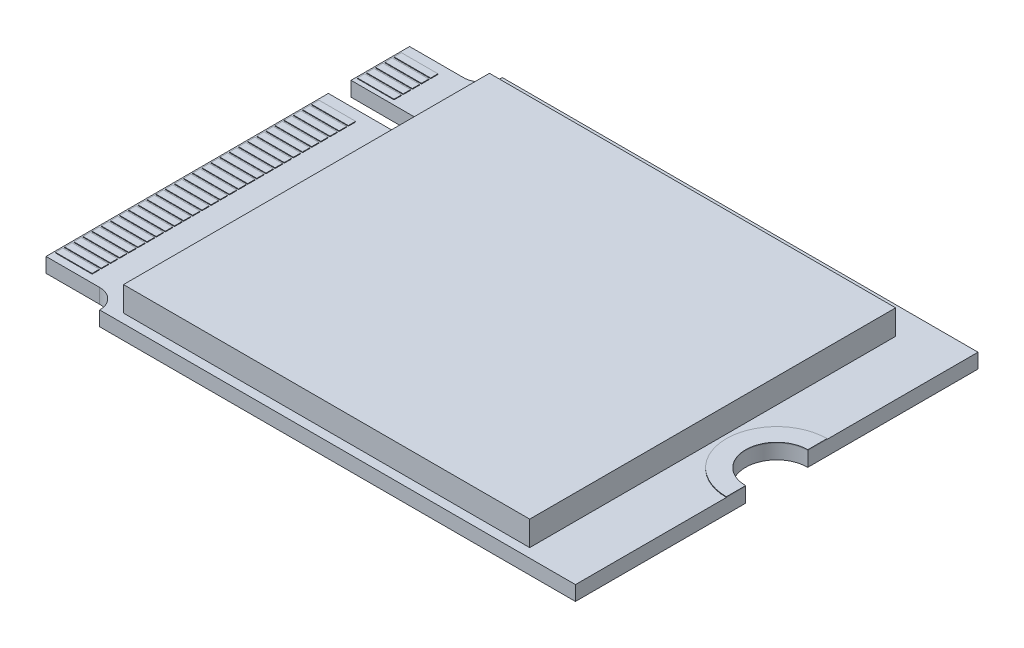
from build123d import *

# Parameters (mm, degrees)
BOSS_EXTRUDE1_DEPTH    = 0.8
SKETCH2_W              = 2
SKETCH2_H              = 0.4
BOSS_EXTRUDE2_DEPTH    = 0.035
BOSS_EXTRUDE2_2_DEPTH  = 0.035
BOSS_EXTRUDE2_3_DEPTH  = 0.035
BOSS_EXTRUDE2_4_DEPTH  = 0.035
BOSS_EXTRUDE2_5_DEPTH  = 0.035
BOSS_EXTRUDE2_6_DEPTH  = 0.035
BOSS_EXTRUDE2_7_DEPTH  = 0.035
BOSS_EXTRUDE2_8_DEPTH  = 0.035
BOSS_EXTRUDE2_9_DEPTH  = 0.035
BOSS_EXTRUDE2_10_DEPTH = 0.035
BOSS_EXTRUDE2_11_DEPTH = 0.035
BOSS_EXTRUDE2_12_DEPTH = 0.035
BOSS_EXTRUDE2_13_DEPTH = 0.035
BOSS_EXTRUDE2_14_DEPTH = 0.035
BOSS_EXTRUDE2_15_DEPTH = 0.035
BOSS_EXTRUDE2_16_DEPTH = 0.035
BOSS_EXTRUDE2_17_DEPTH = 0.035
BOSS_EXTRUDE2_18_DEPTH = 0.035
BOSS_EXTRUDE2_19_DEPTH = 0.035
BOSS_EXTRUDE2_20_DEPTH = 0.035
BOSS_EXTRUDE2_21_DEPTH = 0.035
BOSS_EXTRUDE2_22_DEPTH = 0.035
BOSS_EXTRUDE2_23_DEPTH = 0.035
BOSS_EXTRUDE2_24_DEPTH = 0.035
BOSS_EXTRUDE2_25_DEPTH = 0.035
BOSS_EXTRUDE2_26_DEPTH = 0.035
BOSS_EXTRUDE2_27_DEPTH = 0.035
BOSS_EXTRUDE2_28_DEPTH = 0.035
BOSS_EXTRUDE2_29_DEPTH = 0.035
BOSS_EXTRUDE2_30_DEPTH = 0.035
BOSS_EXTRUDE2_31_DEPTH = 0.035
BOSS_EXTRUDE2_32_DEPTH = 0.035
BOSS_EXTRUDE2_33_DEPTH = 0.035
BOSS_EXTRUDE2_34_DEPTH = 0.035
BOSS_EXTRUDE2_35_DEPTH = 0.035
BOSS_EXTRUDE3_START    = -0.8
SKETCH2_2_W            = 2
SKETCH2_2_H            = 0.4
BOSS_EXTRUDE3_DEPTH    = 0.035
BOSS_EXTRUDE3_2_DEPTH  = 0.035
BOSS_EXTRUDE3_3_DEPTH  = 0.035
BOSS_EXTRUDE3_4_DEPTH  = 0.035
BOSS_EXTRUDE3_5_DEPTH  = 0.035
BOSS_EXTRUDE3_6_DEPTH  = 0.035
BOSS_EXTRUDE3_7_DEPTH  = 0.035
BOSS_EXTRUDE3_8_DEPTH  = 0.035
BOSS_EXTRUDE3_9_DEPTH  = 0.035
BOSS_EXTRUDE3_10_DEPTH = 0.035
BOSS_EXTRUDE3_11_DEPTH = 0.035
BOSS_EXTRUDE3_12_DEPTH = 0.035
BOSS_EXTRUDE3_13_DEPTH = 0.035
BOSS_EXTRUDE3_14_DEPTH = 0.035
BOSS_EXTRUDE3_15_DEPTH = 0.035
BOSS_EXTRUDE3_16_DEPTH = 0.035
BOSS_EXTRUDE3_17_DEPTH = 0.035
BOSS_EXTRUDE3_18_DEPTH = 0.035
BOSS_EXTRUDE3_19_DEPTH = 0.035
BOSS_EXTRUDE3_20_DEPTH = 0.035
BOSS_EXTRUDE3_21_DEPTH = 0.035
BOSS_EXTRUDE3_22_DEPTH = 0.035
BOSS_EXTRUDE3_23_DEPTH = 0.035
BOSS_EXTRUDE3_24_DEPTH = 0.035
BOSS_EXTRUDE3_25_DEPTH = 0.035
BOSS_EXTRUDE3_26_DEPTH = 0.035
BOSS_EXTRUDE3_27_DEPTH = 0.035
BOSS_EXTRUDE3_28_DEPTH = 0.035
BOSS_EXTRUDE3_29_DEPTH = 0.035
SKETCH3_W              = 22.2
SKETCH3_H              = 20
BOSS_EXTRUDE4_DEPTH    = 1.35
SKETCH4_W              = 2
SKETCH4_H              = 0.4
BOSS_EXTRUDE5_DEPTH    = 0.035
BOSS_EXTRUDE5_2_DEPTH  = 0.035
BOSS_EXTRUDE5_3_DEPTH  = 0.035
BOSS_EXTRUDE5_4_DEPTH  = 0.035


with BuildPart() as part:
    # Sketch1 → Boss-Extrude1 (new body)
    with BuildSketch(Plane(origin=(0, 0, 0), x_dir=(1, 0, 0), z_dir=(0, 1, 0))):
        with BuildLine():
            Line((-15, 0), (-15, 5.495))
            Line((-15, 5.495), (-11.6, 5.495))
            ThreePointArc((-11.6, 5.495), (-10.98, 6.115), (-11.6, 6.735))
            Line((-11.6, 6.735), (-15, 6.735))
            Line((-15, 6.735), (-15, 9.935))
            Line((-15, 9.935), (-12.065, 9.935))
            ThreePointArc((-12.065, 9.935), (-11.311931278, 10.246931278), (-11, 11))
            Line((-11, 11), (0, 11))
            Line((0, 11), (15, 11))
            Line((15, 11), (15, 1.7))
            ThreePointArc((15, 1.7), (13.3, 0), (15, -1.7))
            Line((15, -1.7), (15, -11))
            Line((15, -11), (-11, -11))
            ThreePointArc((-11, -11), (-11.311931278, -10.246931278), (-12.065, -9.935))
            Line((-12.065, -9.935), (-15, -9.935))
            Line((-15, -9.935), (-15, 0))
        make_face()
    extrude(amount=BOSS_EXTRUDE1_DEPTH)

    # Sketch3 → Boss-Extrude4 (add)
    with BuildSketch(Plane(origin=(0, 0.8, 0), x_dir=(1, 0, 0), z_dir=(0, 1, 0))):
        with Locations((0.9, -0.5)):
            Rectangle(SKETCH3_W, SKETCH3_H)
    extrude(amount=BOSS_EXTRUDE4_DEPTH)


with BuildPart() as body_2:
    # Sketch2 → Boss-Extrude2 (new body)
    with BuildSketch(Plane(origin=(0, 0.8, 0), x_dir=(1, 0, 0), z_dir=(0, 1, 0))):
        with Locations((-13.9, 9.185)):
            Rectangle(SKETCH2_W, SKETCH2_H)
    extrude(amount=BOSS_EXTRUDE2_DEPTH)


with BuildPart() as body_3:
    # Sketch2 → Boss-Extrude2 2 (new body)
    with BuildSketch(Plane(origin=(0, 0.8, 0), x_dir=(1, 0, 0), z_dir=(0, 1, 0))):
        with Locations((-13.9, 8.685)):
            Rectangle(SKETCH2_W, SKETCH2_H)
    extrude(amount=BOSS_EXTRUDE2_2_DEPTH)


with BuildPart() as body_4:
    # Sketch2 → Boss-Extrude2 3 (new body)
    with BuildSketch(Plane(origin=(0, 0.8, 0), x_dir=(1, 0, 0), z_dir=(0, 1, 0))):
        with Locations((-13.9, 8.185)):
            Rectangle(SKETCH2_W, SKETCH2_H)
    extrude(amount=BOSS_EXTRUDE2_3_DEPTH)


with BuildPart() as body_5:
    # Sketch2 → Boss-Extrude2 4 (new body)
    with BuildSketch(Plane(origin=(0, 0.8, 0), x_dir=(1, 0, 0), z_dir=(0, 1, 0))):
        with Locations((-13.9, 7.685)):
            Rectangle(SKETCH2_W, SKETCH2_H)
    extrude(amount=BOSS_EXTRUDE2_4_DEPTH)


with BuildPart() as body_6:
    # Sketch2 → Boss-Extrude2 5 (new body)
    with BuildSketch(Plane(origin=(0, 0.8, 0), x_dir=(1, 0, 0), z_dir=(0, 1, 0))):
        with Locations((-13.9, 4.685)):
            Rectangle(SKETCH2_W, SKETCH2_H)
    extrude(amount=BOSS_EXTRUDE2_5_DEPTH)


with BuildPart() as body_7:
    # Sketch2 → Boss-Extrude2 6 (new body)
    with BuildSketch(Plane(origin=(0, 0.8, 0), x_dir=(1, 0, 0), z_dir=(0, 1, 0))):
        with Locations((-13.9, 4.185)):
            Rectangle(SKETCH2_W, SKETCH2_H)
    extrude(amount=BOSS_EXTRUDE2_6_DEPTH)


with BuildPart() as body_8:
    # Sketch2 → Boss-Extrude2 7 (new body)
    with BuildSketch(Plane(origin=(0, 0.8, 0), x_dir=(1, 0, 0), z_dir=(0, 1, 0))):
        with Locations((-13.9, 3.685)):
            Rectangle(SKETCH2_W, SKETCH2_H)
    extrude(amount=BOSS_EXTRUDE2_7_DEPTH)


with BuildPart() as body_9:
    # Sketch2 → Boss-Extrude2 8 (new body)
    with BuildSketch(Plane(origin=(0, 0.8, 0), x_dir=(1, 0, 0), z_dir=(0, 1, 0))):
        with Locations((-13.9, 3.185)):
            Rectangle(SKETCH2_W, SKETCH2_H)
    extrude(amount=BOSS_EXTRUDE2_8_DEPTH)


with BuildPart() as body_10:
    # Sketch2 → Boss-Extrude2 9 (new body)
    with BuildSketch(Plane(origin=(0, 0.8, 0), x_dir=(1, 0, 0), z_dir=(0, 1, 0))):
        with Locations((-13.9, 2.685)):
            Rectangle(SKETCH2_W, SKETCH2_H)
    extrude(amount=BOSS_EXTRUDE2_9_DEPTH)


with BuildPart() as body_11:
    # Sketch2 → Boss-Extrude2 10 (new body)
    with BuildSketch(Plane(origin=(0, 0.8, 0), x_dir=(1, 0, 0), z_dir=(0, 1, 0))):
        with Locations((-13.9, 2.185)):
            Rectangle(SKETCH2_W, SKETCH2_H)
    extrude(amount=BOSS_EXTRUDE2_10_DEPTH)


with BuildPart() as body_12:
    # Sketch2 → Boss-Extrude2 11 (new body)
    with BuildSketch(Plane(origin=(0, 0.8, 0), x_dir=(1, 0, 0), z_dir=(0, 1, 0))):
        with Locations((-13.9, 1.685)):
            Rectangle(SKETCH2_W, SKETCH2_H)
    extrude(amount=BOSS_EXTRUDE2_11_DEPTH)


with BuildPart() as body_13:
    # Sketch2 → Boss-Extrude2 12 (new body)
    with BuildSketch(Plane(origin=(0, 0.8, 0), x_dir=(1, 0, 0), z_dir=(0, 1, 0))):
        with Locations((-13.9, 1.185)):
            Rectangle(SKETCH2_W, SKETCH2_H)
    extrude(amount=BOSS_EXTRUDE2_12_DEPTH)


with BuildPart() as body_14:
    # Sketch2 → Boss-Extrude2 13 (new body)
    with BuildSketch(Plane(origin=(0, 0.8, 0), x_dir=(1, 0, 0), z_dir=(0, 1, 0))):
        with Locations((-13.9, 0.685)):
            Rectangle(SKETCH2_W, SKETCH2_H)
    extrude(amount=BOSS_EXTRUDE2_13_DEPTH)


with BuildPart() as body_15:
    # Sketch2 → Boss-Extrude2 14 (new body)
    with BuildSketch(Plane(origin=(0, 0.8, 0), x_dir=(1, 0, 0), z_dir=(0, 1, 0))):
        with Locations((-13.9, 0.185)):
            Rectangle(SKETCH2_W, SKETCH2_H)
    extrude(amount=BOSS_EXTRUDE2_14_DEPTH)


with BuildPart() as body_16:
    # Sketch2 → Boss-Extrude2 15 (new body)
    with BuildSketch(Plane(origin=(0, 0.8, 0), x_dir=(1, 0, 0), z_dir=(0, 1, 0))):
        with Locations((-13.9, -0.315)):
            Rectangle(SKETCH2_W, SKETCH2_H)
    extrude(amount=BOSS_EXTRUDE2_15_DEPTH)


with BuildPart() as body_17:
    # Sketch2 → Boss-Extrude2 16 (new body)
    with BuildSketch(Plane(origin=(0, 0.8, 0), x_dir=(1, 0, 0), z_dir=(0, 1, 0))):
        with Locations((-13.9, -0.815)):
            Rectangle(SKETCH2_W, SKETCH2_H)
    extrude(amount=BOSS_EXTRUDE2_16_DEPTH)


with BuildPart() as body_18:
    # Sketch2 → Boss-Extrude2 17 (new body)
    with BuildSketch(Plane(origin=(0, 0.8, 0), x_dir=(1, 0, 0), z_dir=(0, 1, 0))):
        with Locations((-13.9, -1.315)):
            Rectangle(SKETCH2_W, SKETCH2_H)
    extrude(amount=BOSS_EXTRUDE2_17_DEPTH)


with BuildPart() as body_19:
    # Sketch2 → Boss-Extrude2 18 (new body)
    with BuildSketch(Plane(origin=(0, 0.8, 0), x_dir=(1, 0, 0), z_dir=(0, 1, 0))):
        with Locations((-13.9, -1.815)):
            Rectangle(SKETCH2_W, SKETCH2_H)
    extrude(amount=BOSS_EXTRUDE2_18_DEPTH)


with BuildPart() as body_20:
    # Sketch2 → Boss-Extrude2 19 (new body)
    with BuildSketch(Plane(origin=(0, 0.8, 0), x_dir=(1, 0, 0), z_dir=(0, 1, 0))):
        with Locations((-13.9, -2.315)):
            Rectangle(SKETCH2_W, SKETCH2_H)
    extrude(amount=BOSS_EXTRUDE2_19_DEPTH)


with BuildPart() as body_21:
    # Sketch2 → Boss-Extrude2 20 (new body)
    with BuildSketch(Plane(origin=(0, 0.8, 0), x_dir=(1, 0, 0), z_dir=(0, 1, 0))):
        with Locations((-13.9, -2.815)):
            Rectangle(SKETCH2_W, SKETCH2_H)
    extrude(amount=BOSS_EXTRUDE2_20_DEPTH)


with BuildPart() as body_22:
    # Sketch2 → Boss-Extrude2 21 (new body)
    with BuildSketch(Plane(origin=(0, 0.8, 0), x_dir=(1, 0, 0), z_dir=(0, 1, 0))):
        with Locations((-13.9, -3.315)):
            Rectangle(SKETCH2_W, SKETCH2_H)
    extrude(amount=BOSS_EXTRUDE2_21_DEPTH)


with BuildPart() as body_23:
    # Sketch2 → Boss-Extrude2 22 (new body)
    with BuildSketch(Plane(origin=(0, 0.8, 0), x_dir=(1, 0, 0), z_dir=(0, 1, 0))):
        with Locations((-13.9, -3.815)):
            Rectangle(SKETCH2_W, SKETCH2_H)
    extrude(amount=BOSS_EXTRUDE2_22_DEPTH)


with BuildPart() as body_24:
    # Sketch2 → Boss-Extrude2 23 (new body)
    with BuildSketch(Plane(origin=(0, 0.8, 0), x_dir=(1, 0, 0), z_dir=(0, 1, 0))):
        with Locations((-13.9, -4.315)):
            Rectangle(SKETCH2_W, SKETCH2_H)
    extrude(amount=BOSS_EXTRUDE2_23_DEPTH)


with BuildPart() as body_25:
    # Sketch2 → Boss-Extrude2 24 (new body)
    with BuildSketch(Plane(origin=(0, 0.8, 0), x_dir=(1, 0, 0), z_dir=(0, 1, 0))):
        with Locations((-13.9, -4.815)):
            Rectangle(SKETCH2_W, SKETCH2_H)
    extrude(amount=BOSS_EXTRUDE2_24_DEPTH)


with BuildPart() as body_26:
    # Sketch2 → Boss-Extrude2 25 (new body)
    with BuildSketch(Plane(origin=(0, 0.8, 0), x_dir=(1, 0, 0), z_dir=(0, 1, 0))):
        with Locations((-13.9, -5.315)):
            Rectangle(SKETCH2_W, SKETCH2_H)
    extrude(amount=BOSS_EXTRUDE2_25_DEPTH)


with BuildPart() as body_27:
    # Sketch2 → Boss-Extrude2 26 (new body)
    with BuildSketch(Plane(origin=(0, 0.8, 0), x_dir=(1, 0, 0), z_dir=(0, 1, 0))):
        with Locations((-13.9, -5.815)):
            Rectangle(SKETCH2_W, SKETCH2_H)
    extrude(amount=BOSS_EXTRUDE2_26_DEPTH)


with BuildPart() as body_28:
    # Sketch2 → Boss-Extrude2 27 (new body)
    with BuildSketch(Plane(origin=(0, 0.8, 0), x_dir=(1, 0, 0), z_dir=(0, 1, 0))):
        with Locations((-13.9, -6.315)):
            Rectangle(SKETCH2_W, SKETCH2_H)
    extrude(amount=BOSS_EXTRUDE2_27_DEPTH)


with BuildPart() as body_29:
    # Sketch2 → Boss-Extrude2 28 (new body)
    with BuildSketch(Plane(origin=(0, 0.8, 0), x_dir=(1, 0, 0), z_dir=(0, 1, 0))):
        with Locations((-13.9, -6.815)):
            Rectangle(SKETCH2_W, SKETCH2_H)
    extrude(amount=BOSS_EXTRUDE2_28_DEPTH)


with BuildPart() as body_30:
    # Sketch2 → Boss-Extrude2 29 (new body)
    with BuildSketch(Plane(origin=(0, 0.8, 0), x_dir=(1, 0, 0), z_dir=(0, 1, 0))):
        with Locations((-13.9, -7.315)):
            Rectangle(SKETCH2_W, SKETCH2_H)
    extrude(amount=BOSS_EXTRUDE2_29_DEPTH)


with BuildPart() as body_31:
    # Sketch2 → Boss-Extrude2 30 (new body)
    with BuildSketch(Plane(origin=(0, 0.8, 0), x_dir=(1, 0, 0), z_dir=(0, 1, 0))):
        with Locations((-13.9, -7.815)):
            Rectangle(SKETCH2_W, SKETCH2_H)
    extrude(amount=BOSS_EXTRUDE2_30_DEPTH)


with BuildPart() as body_32:
    # Sketch2 → Boss-Extrude2 31 (new body)
    with BuildSketch(Plane(origin=(0, 0.8, 0), x_dir=(1, 0, 0), z_dir=(0, 1, 0))):
        with Locations((-13.9, -8.315)):
            Rectangle(SKETCH2_W, SKETCH2_H)
    extrude(amount=BOSS_EXTRUDE2_31_DEPTH)


with BuildPart() as body_33:
    # Sketch2 → Boss-Extrude2 32 (new body)
    with BuildSketch(Plane(origin=(0, 0.8, 0), x_dir=(1, 0, 0), z_dir=(0, 1, 0))):
        with Locations((-13.9, -8.815)):
            Rectangle(SKETCH2_W, SKETCH2_H)
    extrude(amount=BOSS_EXTRUDE2_32_DEPTH)


with BuildPart() as body_34:
    # Sketch2 → Boss-Extrude2 33 (new body)
    with BuildSketch(Plane(origin=(0, 0.8, 0), x_dir=(1, 0, 0), z_dir=(0, 1, 0))):
        with Locations((-13.9, -9.315)):
            Rectangle(SKETCH2_W, SKETCH2_H)
    extrude(amount=BOSS_EXTRUDE2_33_DEPTH)


with BuildPart() as body_35:
    # Sketch2 → Boss-Extrude2 34 (new body)
    with BuildSketch(Plane(origin=(0, 0.8, 0), x_dir=(1, 0, 0), z_dir=(0, 1, 0))):
        with Locations((-13.9, 7.185)):
            Rectangle(SKETCH2_W, SKETCH2_H)
    extrude(amount=BOSS_EXTRUDE2_34_DEPTH)


with BuildPart() as body_36:
    # Sketch2 → Boss-Extrude2 35 (new body)
    with BuildSketch(Plane(origin=(0, 0.8, 0), x_dir=(1, 0, 0), z_dir=(0, 1, 0))):
        with BuildLine():
            Line((15, 1.7), (15, 2.75))
            ThreePointArc((15, 2.75), (12.25, 0), (15, -2.75))
            Line((15, -2.75), (15, -1.7))
            ThreePointArc((15, -1.7), (13.3, 0), (15, 1.7))
        make_face()
    extrude(amount=BOSS_EXTRUDE2_35_DEPTH)


with BuildPart() as body_37:
    # Sketch2_2 → Boss-Extrude3 (new body)
    with BuildSketch(Plane(origin=(0, 0.8, 0), x_dir=(1, 0, 0), z_dir=(0, 1, 0)).offset(BOSS_EXTRUDE3_START)):
        with Locations((-13.9, 4.685)):
            Rectangle(SKETCH2_2_W, SKETCH2_2_H)
    extrude(amount=-BOSS_EXTRUDE3_DEPTH)


with BuildPart() as body_38:
    # Sketch2_2 → Boss-Extrude3 2 (new body)
    with BuildSketch(Plane(origin=(0, 0.8, 0), x_dir=(1, 0, 0), z_dir=(0, 1, 0)).offset(BOSS_EXTRUDE3_START)):
        with Locations((-13.9, 4.185)):
            Rectangle(SKETCH2_2_W, SKETCH2_2_H)
    extrude(amount=-BOSS_EXTRUDE3_2_DEPTH)


with BuildPart() as body_39:
    # Sketch2_2 → Boss-Extrude3 3 (new body)
    with BuildSketch(Plane(origin=(0, 0.8, 0), x_dir=(1, 0, 0), z_dir=(0, 1, 0)).offset(BOSS_EXTRUDE3_START)):
        with Locations((-13.9, 3.685)):
            Rectangle(SKETCH2_2_W, SKETCH2_2_H)
    extrude(amount=-BOSS_EXTRUDE3_3_DEPTH)


with BuildPart() as body_40:
    # Sketch2_2 → Boss-Extrude3 4 (new body)
    with BuildSketch(Plane(origin=(0, 0.8, 0), x_dir=(1, 0, 0), z_dir=(0, 1, 0)).offset(BOSS_EXTRUDE3_START)):
        with Locations((-13.9, 3.185)):
            Rectangle(SKETCH2_2_W, SKETCH2_2_H)
    extrude(amount=-BOSS_EXTRUDE3_4_DEPTH)


with BuildPart() as body_41:
    # Sketch2_2 → Boss-Extrude3 5 (new body)
    with BuildSketch(Plane(origin=(0, 0.8, 0), x_dir=(1, 0, 0), z_dir=(0, 1, 0)).offset(BOSS_EXTRUDE3_START)):
        with Locations((-13.9, 2.185)):
            Rectangle(SKETCH2_2_W, SKETCH2_2_H)
    extrude(amount=-BOSS_EXTRUDE3_5_DEPTH)


with BuildPart() as body_42:
    # Sketch2_2 → Boss-Extrude3 6 (new body)
    with BuildSketch(Plane(origin=(0, 0.8, 0), x_dir=(1, 0, 0), z_dir=(0, 1, 0)).offset(BOSS_EXTRUDE3_START)):
        with Locations((-13.9, 1.185)):
            Rectangle(SKETCH2_2_W, SKETCH2_2_H)
    extrude(amount=-BOSS_EXTRUDE3_6_DEPTH)


with BuildPart() as body_43:
    # Sketch2_2 → Boss-Extrude3 7 (new body)
    with BuildSketch(Plane(origin=(0, 0.8, 0), x_dir=(1, 0, 0), z_dir=(0, 1, 0)).offset(BOSS_EXTRUDE3_START)):
        with Locations((-13.9, 0.685)):
            Rectangle(SKETCH2_2_W, SKETCH2_2_H)
    extrude(amount=-BOSS_EXTRUDE3_7_DEPTH)


with BuildPart() as body_44:
    # Sketch2_2 → Boss-Extrude3 8 (new body)
    with BuildSketch(Plane(origin=(0, 0.8, 0), x_dir=(1, 0, 0), z_dir=(0, 1, 0)).offset(BOSS_EXTRUDE3_START)):
        with Locations((-13.9, 0.185)):
            Rectangle(SKETCH2_2_W, SKETCH2_2_H)
    extrude(amount=-BOSS_EXTRUDE3_8_DEPTH)


with BuildPart() as body_45:
    # Sketch2_2 → Boss-Extrude3 9 (new body)
    with BuildSketch(Plane(origin=(0, 0.8, 0), x_dir=(1, 0, 0), z_dir=(0, 1, 0)).offset(BOSS_EXTRUDE3_START)):
        with Locations((-13.9, -5.815)):
            Rectangle(SKETCH2_2_W, SKETCH2_2_H)
    extrude(amount=-BOSS_EXTRUDE3_9_DEPTH)


with BuildPart() as body_46:
    # Sketch2_2 → Boss-Extrude3 10 (new body)
    with BuildSketch(Plane(origin=(0, 0.8, 0), x_dir=(1, 0, 0), z_dir=(0, 1, 0)).offset(BOSS_EXTRUDE3_START)):
        with Locations((-13.9, -7.315)):
            Rectangle(SKETCH2_2_W, SKETCH2_2_H)
    extrude(amount=-BOSS_EXTRUDE3_10_DEPTH)


with BuildPart() as body_47:
    # Sketch2_2 → Boss-Extrude3 11 (new body)
    with BuildSketch(Plane(origin=(0, 0.8, 0), x_dir=(1, 0, 0), z_dir=(0, 1, 0)).offset(BOSS_EXTRUDE3_START)):
        with Locations((-13.9, -8.315)):
            Rectangle(SKETCH2_2_W, SKETCH2_2_H)
    extrude(amount=-BOSS_EXTRUDE3_11_DEPTH)


with BuildPart() as body_48:
    # Sketch2_2 → Boss-Extrude3 12 (new body)
    with BuildSketch(Plane(origin=(0, 0.8, 0), x_dir=(1, 0, 0), z_dir=(0, 1, 0)).offset(BOSS_EXTRUDE3_START)):
        with Locations((-13.9, -8.815)):
            Rectangle(SKETCH2_2_W, SKETCH2_2_H)
    extrude(amount=-BOSS_EXTRUDE3_12_DEPTH)


with BuildPart() as body_49:
    # Sketch2_2 → Boss-Extrude3 13 (new body)
    with BuildSketch(Plane(origin=(0, 0.8, 0), x_dir=(1, 0, 0), z_dir=(0, 1, 0)).offset(BOSS_EXTRUDE3_START)):
        with Locations((-13.9, 2.685)):
            Rectangle(SKETCH2_2_W, SKETCH2_2_H)
    extrude(amount=-BOSS_EXTRUDE3_13_DEPTH)


with BuildPart() as body_50:
    # Sketch2_2 → Boss-Extrude3 14 (new body)
    with BuildSketch(Plane(origin=(0, 0.8, 0), x_dir=(1, 0, 0), z_dir=(0, 1, 0)).offset(BOSS_EXTRUDE3_START)):
        with Locations((-13.9, 1.685)):
            Rectangle(SKETCH2_2_W, SKETCH2_2_H)
    extrude(amount=-BOSS_EXTRUDE3_14_DEPTH)


with BuildPart() as body_51:
    # Sketch2_2 → Boss-Extrude3 15 (new body)
    with BuildSketch(Plane(origin=(0, 0.8, 0), x_dir=(1, 0, 0), z_dir=(0, 1, 0)).offset(BOSS_EXTRUDE3_START)):
        with Locations((-13.9, -0.315)):
            Rectangle(SKETCH2_2_W, SKETCH2_2_H)
    extrude(amount=-BOSS_EXTRUDE3_15_DEPTH)


with BuildPart() as body_52:
    # Sketch2_2 → Boss-Extrude3 16 (new body)
    with BuildSketch(Plane(origin=(0, 0.8, 0), x_dir=(1, 0, 0), z_dir=(0, 1, 0)).offset(BOSS_EXTRUDE3_START)):
        with Locations((-13.9, -0.815)):
            Rectangle(SKETCH2_2_W, SKETCH2_2_H)
    extrude(amount=-BOSS_EXTRUDE3_16_DEPTH)


with BuildPart() as body_53:
    # Sketch2_2 → Boss-Extrude3 17 (new body)
    with BuildSketch(Plane(origin=(0, 0.8, 0), x_dir=(1, 0, 0), z_dir=(0, 1, 0)).offset(BOSS_EXTRUDE3_START)):
        with Locations((-13.9, -1.315)):
            Rectangle(SKETCH2_2_W, SKETCH2_2_H)
    extrude(amount=-BOSS_EXTRUDE3_17_DEPTH)


with BuildPart() as body_54:
    # Sketch2_2 → Boss-Extrude3 18 (new body)
    with BuildSketch(Plane(origin=(0, 0.8, 0), x_dir=(1, 0, 0), z_dir=(0, 1, 0)).offset(BOSS_EXTRUDE3_START)):
        with Locations((-13.9, -1.815)):
            Rectangle(SKETCH2_2_W, SKETCH2_2_H)
    extrude(amount=-BOSS_EXTRUDE3_18_DEPTH)


with BuildPart() as body_55:
    # Sketch2_2 → Boss-Extrude3 19 (new body)
    with BuildSketch(Plane(origin=(0, 0.8, 0), x_dir=(1, 0, 0), z_dir=(0, 1, 0)).offset(BOSS_EXTRUDE3_START)):
        with Locations((-13.9, -2.315)):
            Rectangle(SKETCH2_2_W, SKETCH2_2_H)
    extrude(amount=-BOSS_EXTRUDE3_19_DEPTH)


with BuildPart() as body_56:
    # Sketch2_2 → Boss-Extrude3 20 (new body)
    with BuildSketch(Plane(origin=(0, 0.8, 0), x_dir=(1, 0, 0), z_dir=(0, 1, 0)).offset(BOSS_EXTRUDE3_START)):
        with Locations((-13.9, -2.815)):
            Rectangle(SKETCH2_2_W, SKETCH2_2_H)
    extrude(amount=-BOSS_EXTRUDE3_20_DEPTH)


with BuildPart() as body_57:
    # Sketch2_2 → Boss-Extrude3 21 (new body)
    with BuildSketch(Plane(origin=(0, 0.8, 0), x_dir=(1, 0, 0), z_dir=(0, 1, 0)).offset(BOSS_EXTRUDE3_START)):
        with Locations((-13.9, -3.315)):
            Rectangle(SKETCH2_2_W, SKETCH2_2_H)
    extrude(amount=-BOSS_EXTRUDE3_21_DEPTH)


with BuildPart() as body_58:
    # Sketch2_2 → Boss-Extrude3 22 (new body)
    with BuildSketch(Plane(origin=(0, 0.8, 0), x_dir=(1, 0, 0), z_dir=(0, 1, 0)).offset(BOSS_EXTRUDE3_START)):
        with Locations((-13.9, -3.815)):
            Rectangle(SKETCH2_2_W, SKETCH2_2_H)
    extrude(amount=-BOSS_EXTRUDE3_22_DEPTH)


with BuildPart() as body_59:
    # Sketch2_2 → Boss-Extrude3 23 (new body)
    with BuildSketch(Plane(origin=(0, 0.8, 0), x_dir=(1, 0, 0), z_dir=(0, 1, 0)).offset(BOSS_EXTRUDE3_START)):
        with Locations((-13.9, -4.315)):
            Rectangle(SKETCH2_2_W, SKETCH2_2_H)
    extrude(amount=-BOSS_EXTRUDE3_23_DEPTH)


with BuildPart() as body_60:
    # Sketch2_2 → Boss-Extrude3 24 (new body)
    with BuildSketch(Plane(origin=(0, 0.8, 0), x_dir=(1, 0, 0), z_dir=(0, 1, 0)).offset(BOSS_EXTRUDE3_START)):
        with Locations((-13.9, -4.815)):
            Rectangle(SKETCH2_2_W, SKETCH2_2_H)
    extrude(amount=-BOSS_EXTRUDE3_24_DEPTH)


with BuildPart() as body_61:
    # Sketch2_2 → Boss-Extrude3 25 (new body)
    with BuildSketch(Plane(origin=(0, 0.8, 0), x_dir=(1, 0, 0), z_dir=(0, 1, 0)).offset(BOSS_EXTRUDE3_START)):
        with Locations((-13.9, -5.315)):
            Rectangle(SKETCH2_2_W, SKETCH2_2_H)
    extrude(amount=-BOSS_EXTRUDE3_25_DEPTH)


with BuildPart() as body_62:
    # Sketch2_2 → Boss-Extrude3 26 (new body)
    with BuildSketch(Plane(origin=(0, 0.8, 0), x_dir=(1, 0, 0), z_dir=(0, 1, 0)).offset(BOSS_EXTRUDE3_START)):
        with Locations((-13.9, -6.315)):
            Rectangle(SKETCH2_2_W, SKETCH2_2_H)
    extrude(amount=-BOSS_EXTRUDE3_26_DEPTH)


with BuildPart() as body_63:
    # Sketch2_2 → Boss-Extrude3 27 (new body)
    with BuildSketch(Plane(origin=(0, 0.8, 0), x_dir=(1, 0, 0), z_dir=(0, 1, 0)).offset(BOSS_EXTRUDE3_START)):
        with Locations((-13.9, -6.815)):
            Rectangle(SKETCH2_2_W, SKETCH2_2_H)
    extrude(amount=-BOSS_EXTRUDE3_27_DEPTH)


with BuildPart() as body_64:
    # Sketch2_2 → Boss-Extrude3 28 (new body)
    with BuildSketch(Plane(origin=(0, 0.8, 0), x_dir=(1, 0, 0), z_dir=(0, 1, 0)).offset(BOSS_EXTRUDE3_START)):
        with Locations((-13.9, -7.815)):
            Rectangle(SKETCH2_2_W, SKETCH2_2_H)
    extrude(amount=-BOSS_EXTRUDE3_28_DEPTH)


with BuildPart() as body_65:
    # Sketch2_2 → Boss-Extrude3 29 (new body)
    with BuildSketch(Plane(origin=(0, 0.8, 0), x_dir=(1, 0, 0), z_dir=(0, 1, 0)).offset(BOSS_EXTRUDE3_START)):
        with Locations((-13.9, -9.315)):
            Rectangle(SKETCH2_2_W, SKETCH2_2_H)
    extrude(amount=-BOSS_EXTRUDE3_29_DEPTH)


with BuildPart() as body_66:
    # Sketch4 → Boss-Extrude5 (new body)
    with BuildSketch(Plane.XZ):
        with Locations((-13.9, -7.435)):
            Rectangle(SKETCH4_W, SKETCH4_H)
    extrude(amount=BOSS_EXTRUDE5_DEPTH)


with BuildPart() as body_67:
    # Sketch4 → Boss-Extrude5 2 (new body)
    with BuildSketch(Plane.XZ):
        with Locations((-13.9, -7.935)):
            Rectangle(SKETCH4_W, SKETCH4_H)
    extrude(amount=BOSS_EXTRUDE5_2_DEPTH)


with BuildPart() as body_68:
    # Sketch4 → Boss-Extrude5 3 (new body)
    with BuildSketch(Plane.XZ):
        with Locations((-13.9, -8.435)):
            Rectangle(SKETCH4_W, SKETCH4_H)
    extrude(amount=BOSS_EXTRUDE5_3_DEPTH)


with BuildPart() as body_69:
    # Sketch4 → Boss-Extrude5 4 (new body)
    with BuildSketch(Plane.XZ):
        with Locations((-13.9, -8.935)):
            Rectangle(SKETCH4_W, SKETCH4_H)
    extrude(amount=BOSS_EXTRUDE5_4_DEPTH)


solid = Compound([part.part, body_2.part, body_3.part, body_4.part, body_5.part, body_6.part, body_7.part, body_8.part, body_9.part, body_10.part, body_11.part, body_12.part, body_13.part, body_14.part, body_15.part, body_16.part, body_17.part, body_18.part, body_19.part, body_20.part, body_21.part, body_22.part, body_23.part, body_24.part, body_25.part, body_26.part, body_27.part, body_28.part, body_29.part, body_30.part, body_31.part, body_32.part, body_33.part, body_34.part, body_35.part, body_36.part, body_37.part, body_38.part, body_39.part, body_40.part, body_41.part, body_42.part, body_43.part, body_44.part, body_45.part, body_46.part, body_47.part, body_48.part, body_49.part, body_50.part, body_51.part, body_52.part, body_53.part, body_54.part, body_55.part, body_56.part, body_57.part, body_58.part, body_59.part, body_60.part, body_61.part, body_62.part, body_63.part, body_64.part, body_65.part, body_66.part, body_67.part, body_68.part, body_69.part])
